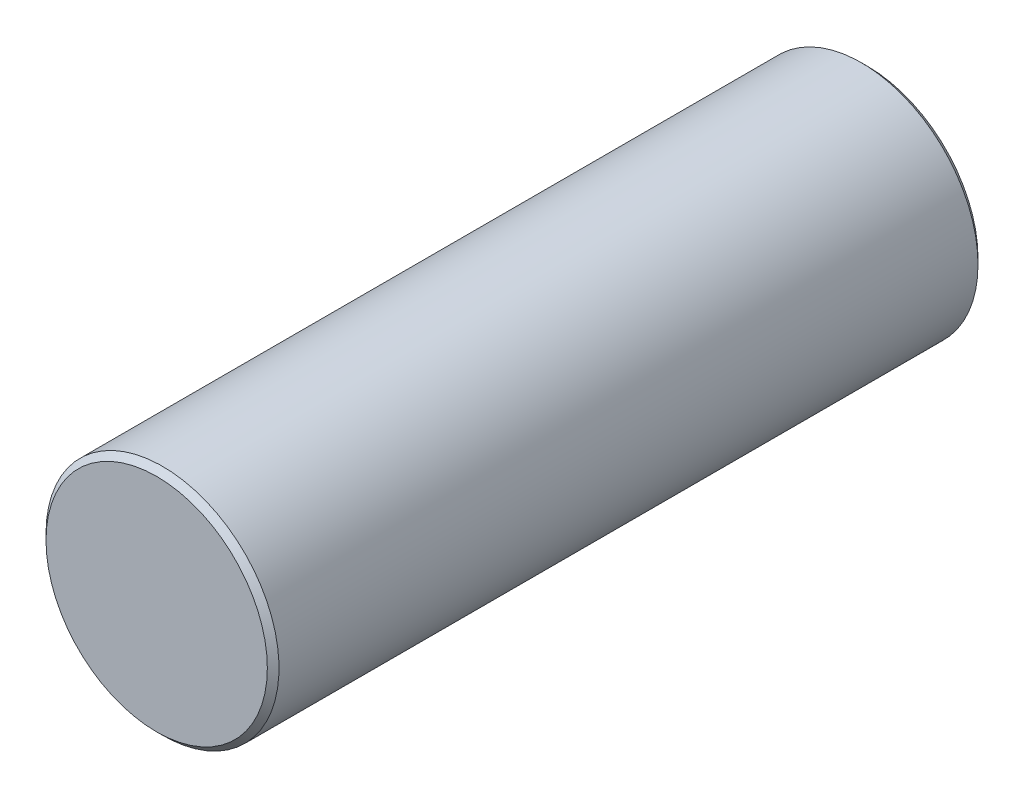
from build123d import *

# Parameters (mm, degrees)
SKETCH_1_R      = 10
EXTRUDE_1_DEPTH = 30.5
CHAMFER_1_SIZE  = 0.5


with BuildPart() as part:
    # Sketch 1 → Extrude 1 (new, symmetric)
    with BuildSketch(Plane.XY):
        with Locations(Location((0, 0, 0), (0, 0, 180))):
            Circle(SKETCH_1_R)
    extrude(amount=EXTRUDE_1_DEPTH, both=True)

    # Chamfer 1
    chamfer_1_edges = [part.edges().sort_by_distance(p)[0] for p in [
        (10, 0, -30.5),
        (10, 0, 30.5),
    ]]
    chamfer(chamfer_1_edges, length=CHAMFER_1_SIZE)


solid = part.part
